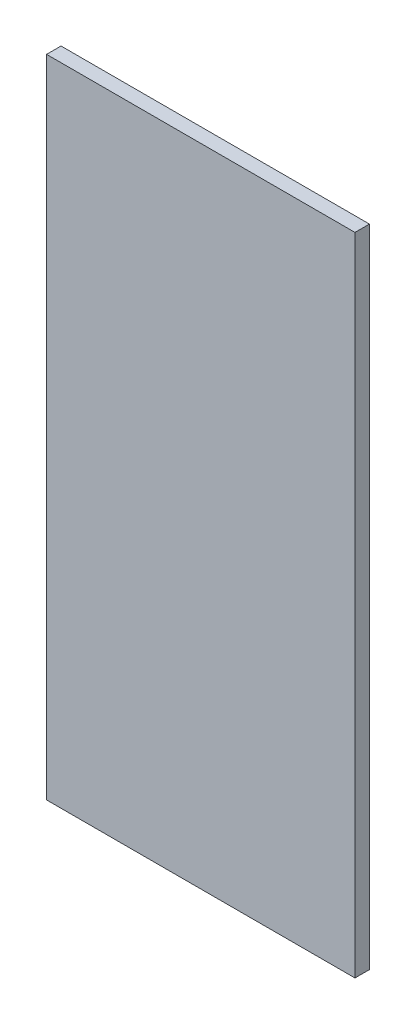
ISO-10303-21;
HEADER;
FILE_DESCRIPTION(('STEP AP214'),'2;1');
FILE_NAME('part.step','',(''),(''),'','','');
FILE_SCHEMA(('AUTOMOTIVE_DESIGN { 1 0 10303 214 1 1 1 1 }'));
ENDSEC;
DATA;
#1=APPLICATION_CONTEXT('core data for automotive mechanical design processes');
#2=APPLICATION_PROTOCOL_DEFINITION('international standard','automotive_design',2000,#1);
#3=PRODUCT_CONTEXT('',#1,'mechanical');
#4=PRODUCT('Part','Part','',(#3));
#5=PRODUCT_RELATED_PRODUCT_CATEGORY('part','',(#4));
#6=PRODUCT_DEFINITION_FORMATION('','',#4);
#7=PRODUCT_DEFINITION_CONTEXT('part definition',#1,'design');
#8=PRODUCT_DEFINITION('design','',#6,#7);
#9=PRODUCT_DEFINITION_SHAPE('','',#8);
#10=(LENGTH_UNIT() NAMED_UNIT(*) SI_UNIT(.MILLI.,.METRE.));
#11=(NAMED_UNIT(*) PLANE_ANGLE_UNIT() SI_UNIT($,.RADIAN.));
#12=(NAMED_UNIT(*) SI_UNIT($,.STERADIAN.) SOLID_ANGLE_UNIT());
#13=UNCERTAINTY_MEASURE_WITH_UNIT(LENGTH_MEASURE(1.E-05),#10,'distance_accuracy_value','');
#14=(GEOMETRIC_REPRESENTATION_CONTEXT(3) GLOBAL_UNCERTAINTY_ASSIGNED_CONTEXT((#13)) GLOBAL_UNIT_ASSIGNED_CONTEXT((#10,
#11,#12)) REPRESENTATION_CONTEXT('',''));
#15=CARTESIAN_POINT('',(0.,0.,0.));
#16=DIRECTION('',(0.,0.,1.));
#17=DIRECTION('',(1.,0.,0.));
#18=AXIS2_PLACEMENT_3D('',#15,#16,#17);
#19=CARTESIAN_POINT('',(-0.8128,-1.7018,0.));
#20=DIRECTION('',(0.,0.,1.));
#21=DIRECTION('',(1.,0.,0.));
#22=AXIS2_PLACEMENT_3D('',#19,#20,#21);
#23=PLANE('',#22);
#24=DIRECTION('',(-1.,0.,0.));
#25=VECTOR('',#24,1.);
#26=CARTESIAN_POINT('',(0.,1.7018,0.));
#27=LINE('',#26,#25);
#28=CARTESIAN_POINT('',(0.8128,1.7018,0.));
#29=VERTEX_POINT('',#28);
#30=CARTESIAN_POINT('',(-0.8128,1.7018,0.));
#31=VERTEX_POINT('',#30);
#32=EDGE_CURVE('E56',#29,#31,#27,.T.);
#33=ORIENTED_EDGE('',*,*,#32,.F.);
#34=DIRECTION('',(0.,1.,0.));
#35=VECTOR('',#34,1.);
#36=CARTESIAN_POINT('',(0.8128,0.,0.));
#37=LINE('',#36,#35);
#38=CARTESIAN_POINT('',(0.8128,-1.7018,0.));
#39=VERTEX_POINT('',#38);
#40=EDGE_CURVE('E58',#39,#29,#37,.T.);
#41=ORIENTED_EDGE('',*,*,#40,.F.);
#42=DIRECTION('',(1.,0.,0.));
#43=VECTOR('',#42,1.);
#44=CARTESIAN_POINT('',(0.,-1.7018,0.));
#45=LINE('',#44,#43);
#46=CARTESIAN_POINT('',(-0.8128,-1.7018,0.));
#47=VERTEX_POINT('',#46);
#48=EDGE_CURVE('E21',#47,#39,#45,.T.);
#49=ORIENTED_EDGE('',*,*,#48,.F.);
#50=DIRECTION('',(0.,-1.,0.));
#51=VECTOR('',#50,1.);
#52=CARTESIAN_POINT('',(-0.8128,0.,0.));
#53=LINE('',#52,#51);
#54=EDGE_CURVE('E81',#31,#47,#53,.T.);
#55=ORIENTED_EDGE('',*,*,#54,.F.);
#56=EDGE_LOOP('',(#33,#41,#49,#55));
#57=FACE_BOUND('',#56,.T.);
#58=ADVANCED_FACE('F17',(#57),#23,.F.);
#59=CARTESIAN_POINT('',(-0.8128,-1.7018,0.0762));
#60=DIRECTION('',(0.,-1.,0.));
#61=DIRECTION('',(0.,0.,-1.));
#62=AXIS2_PLACEMENT_3D('',#59,#60,#61);
#63=PLANE('',#62);
#64=DIRECTION('',(0.,0.,1.));
#65=VECTOR('',#64,1.);
#66=CARTESIAN_POINT('',(-0.8128,-1.7018,0.0381));
#67=LINE('',#66,#65);
#68=CARTESIAN_POINT('',(-0.8128,-1.7018,0.0762));
#69=VERTEX_POINT('',#68);
#70=EDGE_CURVE('E69',#47,#69,#67,.T.);
#71=ORIENTED_EDGE('',*,*,#70,.F.);
#72=ORIENTED_EDGE('',*,*,#48,.T.);
#73=DIRECTION('',(0.,0.,-1.));
#74=VECTOR('',#73,1.);
#75=CARTESIAN_POINT('',(0.8128,-1.7018,0.0381));
#76=LINE('',#75,#74);
#77=CARTESIAN_POINT('',(0.8128,-1.7018,0.0762));
#78=VERTEX_POINT('',#77);
#79=EDGE_CURVE('E64',#78,#39,#76,.T.);
#80=ORIENTED_EDGE('',*,*,#79,.F.);
#81=DIRECTION('',(1.,0.,0.));
#82=VECTOR('',#81,1.);
#83=CARTESIAN_POINT('',(0.,-1.7018,0.0762));
#84=LINE('',#83,#82);
#85=EDGE_CURVE('E84',#69,#78,#84,.T.);
#86=ORIENTED_EDGE('',*,*,#85,.F.);
#87=EDGE_LOOP('',(#71,#72,#80,#86));
#88=FACE_BOUND('',#87,.T.);
#89=ADVANCED_FACE('F66',(#88),#63,.T.);
#90=CARTESIAN_POINT('',(0.8128,-1.7018,0.0762));
#91=DIRECTION('',(1.,0.,0.));
#92=DIRECTION('',(0.,0.,-1.));
#93=AXIS2_PLACEMENT_3D('',#90,#91,#92);
#94=PLANE('',#93);
#95=ORIENTED_EDGE('',*,*,#79,.T.);
#96=ORIENTED_EDGE('',*,*,#40,.T.);
#97=DIRECTION('',(0.,0.,-1.));
#98=VECTOR('',#97,1.);
#99=CARTESIAN_POINT('',(0.8128,1.7018,0.0381));
#100=LINE('',#99,#98);
#101=CARTESIAN_POINT('',(0.8128,1.7018,0.0762));
#102=VERTEX_POINT('',#101);
#103=EDGE_CURVE('E76',#102,#29,#100,.T.);
#104=ORIENTED_EDGE('',*,*,#103,.F.);
#105=DIRECTION('',(0.,1.,0.));
#106=VECTOR('',#105,1.);
#107=CARTESIAN_POINT('',(0.8128,0.,0.0762));
#108=LINE('',#107,#106);
#109=EDGE_CURVE('E73',#78,#102,#108,.T.);
#110=ORIENTED_EDGE('',*,*,#109,.F.);
#111=EDGE_LOOP('',(#95,#96,#104,#110));
#112=FACE_BOUND('',#111,.T.);
#113=ADVANCED_FACE('F71',(#112),#94,.T.);
#114=CARTESIAN_POINT('',(0.8128,1.7018,0.0762));
#115=DIRECTION('',(0.,1.,0.));
#116=DIRECTION('',(0.,0.,-1.));
#117=AXIS2_PLACEMENT_3D('',#114,#115,#116);
#118=PLANE('',#117);
#119=ORIENTED_EDGE('',*,*,#103,.T.);
#120=ORIENTED_EDGE('',*,*,#32,.T.);
#121=DIRECTION('',(0.,0.,-1.));
#122=VECTOR('',#121,1.);
#123=CARTESIAN_POINT('',(-0.8128,1.7018,0.0381));
#124=LINE('',#123,#122);
#125=CARTESIAN_POINT('',(-0.8128,1.7018,0.0762));
#126=VERTEX_POINT('',#125);
#127=EDGE_CURVE('E36',#126,#31,#124,.T.);
#128=ORIENTED_EDGE('',*,*,#127,.F.);
#129=DIRECTION('',(-1.,0.,0.));
#130=VECTOR('',#129,1.);
#131=CARTESIAN_POINT('',(0.,1.7018,0.0762));
#132=LINE('',#131,#130);
#133=EDGE_CURVE('E27',#102,#126,#132,.T.);
#134=ORIENTED_EDGE('',*,*,#133,.F.);
#135=EDGE_LOOP('',(#119,#120,#128,#134));
#136=FACE_BOUND('',#135,.T.);
#137=ADVANCED_FACE('F89',(#136),#118,.T.);
#138=CARTESIAN_POINT('',(-0.8128,1.7018,0.0762));
#139=DIRECTION('',(-1.,0.,0.));
#140=DIRECTION('',(0.,0.,-1.));
#141=AXIS2_PLACEMENT_3D('',#138,#139,#140);
#142=PLANE('',#141);
#143=ORIENTED_EDGE('',*,*,#127,.T.);
#144=ORIENTED_EDGE('',*,*,#54,.T.);
#145=ORIENTED_EDGE('',*,*,#70,.T.);
#146=DIRECTION('',(0.,-1.,0.));
#147=VECTOR('',#146,1.);
#148=CARTESIAN_POINT('',(-0.8128,0.,0.0762));
#149=LINE('',#148,#147);
#150=EDGE_CURVE('E11',#126,#69,#149,.T.);
#151=ORIENTED_EDGE('',*,*,#150,.F.);
#152=EDGE_LOOP('',(#143,#144,#145,#151));
#153=FACE_BOUND('',#152,.T.);
#154=ADVANCED_FACE('F91',(#153),#142,.T.);
#155=CARTESIAN_POINT('',(-0.8128,-1.7018,0.0762));
#156=DIRECTION('',(0.,0.,1.));
#157=DIRECTION('',(1.,0.,0.));
#158=AXIS2_PLACEMENT_3D('',#155,#156,#157);
#159=PLANE('',#158);
#160=ORIENTED_EDGE('',*,*,#133,.T.);
#161=ORIENTED_EDGE('',*,*,#150,.T.);
#162=ORIENTED_EDGE('',*,*,#85,.T.);
#163=ORIENTED_EDGE('',*,*,#109,.T.);
#164=EDGE_LOOP('',(#160,#161,#162,#163));
#165=FACE_BOUND('',#164,.T.);
#166=ADVANCED_FACE('F19',(#165),#159,.T.);
#167=CLOSED_SHELL('',(#58,#89,#113,#137,#154,#166));
#168=MANIFOLD_SOLID_BREP('B1',#167);
#169=ADVANCED_BREP_SHAPE_REPRESENTATION('',(#18,#168),#14);
#170=SHAPE_DEFINITION_REPRESENTATION(#9,#169);
ENDSEC;
END-ISO-10303-21;
